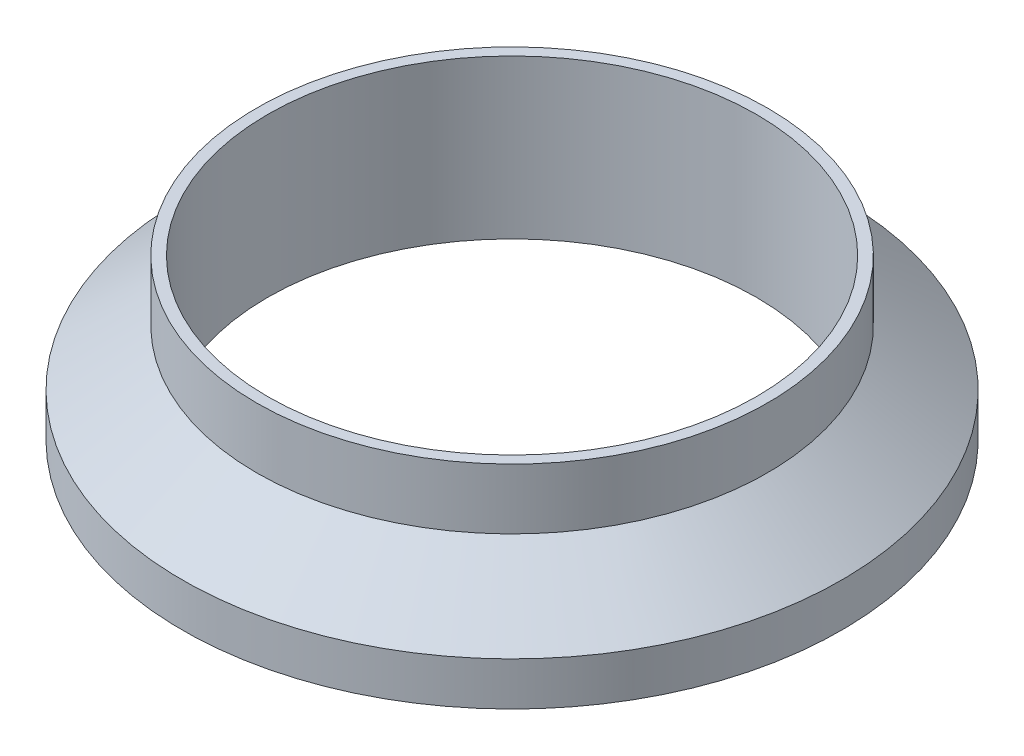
ISO-10303-21;
HEADER;
FILE_DESCRIPTION(('STEP AP214'),'2;1');
FILE_NAME('part.step','',(''),(''),'','','');
FILE_SCHEMA(('AUTOMOTIVE_DESIGN { 1 0 10303 214 1 1 1 1 }'));
ENDSEC;
DATA;
#1=APPLICATION_CONTEXT('core data for automotive mechanical design processes');
#2=APPLICATION_PROTOCOL_DEFINITION('international standard','automotive_design',2000,#1);
#3=PRODUCT_CONTEXT('',#1,'mechanical');
#4=PRODUCT('Part','Part','',(#3));
#5=PRODUCT_RELATED_PRODUCT_CATEGORY('part','',(#4));
#6=PRODUCT_DEFINITION_FORMATION('','',#4);
#7=PRODUCT_DEFINITION_CONTEXT('part definition',#1,'design');
#8=PRODUCT_DEFINITION('design','',#6,#7);
#9=PRODUCT_DEFINITION_SHAPE('','',#8);
#10=(LENGTH_UNIT() NAMED_UNIT(*) SI_UNIT(.MILLI.,.METRE.));
#11=(NAMED_UNIT(*) PLANE_ANGLE_UNIT() SI_UNIT($,.RADIAN.));
#12=(NAMED_UNIT(*) SI_UNIT($,.STERADIAN.) SOLID_ANGLE_UNIT());
#13=UNCERTAINTY_MEASURE_WITH_UNIT(LENGTH_MEASURE(1.E-05),#10,'distance_accuracy_value','');
#14=(GEOMETRIC_REPRESENTATION_CONTEXT(3) GLOBAL_UNCERTAINTY_ASSIGNED_CONTEXT((#13)) GLOBAL_UNIT_ASSIGNED_CONTEXT((#10,
#11,#12)) REPRESENTATION_CONTEXT('',''));
#15=CARTESIAN_POINT('',(0.,0.,0.));
#16=DIRECTION('',(0.,0.,1.));
#17=DIRECTION('',(1.,0.,0.));
#18=AXIS2_PLACEMENT_3D('',#15,#16,#17);
#19=CARTESIAN_POINT('',(-36.449,0.196645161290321,0.));
#20=DIRECTION('',(0.,1.,0.));
#21=DIRECTION('',(0.,0.,1.));
#22=AXIS2_PLACEMENT_3D('',#19,#20,#21);
#23=PLANE('',#22);
#24=CARTESIAN_POINT('',(0.,0.196645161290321,0.));
#25=DIRECTION('',(0.,-1.,0.));
#26=DIRECTION('',(0.,0.,-1.));
#27=AXIS2_PLACEMENT_3D('',#24,#25,#26);
#28=CIRCLE('',#27,36.449);
#29=CARTESIAN_POINT('',(0.,0.196645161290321,-36.449));
#30=VERTEX_POINT('',#29);
#31=EDGE_CURVE('E10',#30,#30,#28,.T.);
#32=ORIENTED_EDGE('',*,*,#31,.F.);
#33=EDGE_LOOP('',(#32));
#34=FACE_BOUND('',#33,.T.);
#35=CARTESIAN_POINT('',(0.,0.196645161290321,0.));
#36=DIRECTION('',(0.,-1.,0.));
#37=DIRECTION('',(0.,0.,-1.));
#38=AXIS2_PLACEMENT_3D('',#35,#36,#37);
#39=CIRCLE('',#38,40.482330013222);
#40=CARTESIAN_POINT('',(0.,0.196645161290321,-40.482330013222));
#41=VERTEX_POINT('',#40);
#42=EDGE_CURVE('E59',#41,#41,#39,.T.);
#43=ORIENTED_EDGE('',*,*,#42,.T.);
#44=EDGE_LOOP('',(#43));
#45=FACE_BOUND('',#44,.T.);
#46=ADVANCED_FACE('F31',(#34,#45),#23,.F.);
#47=CARTESIAN_POINT('',(0.,0.,0.));
#48=DIRECTION('',(0.,-1.,0.));
#49=DIRECTION('',(0.,0.,-1.));
#50=AXIS2_PLACEMENT_3D('',#47,#48,#49);
#51=CYLINDRICAL_SURFACE('',#50,36.449);
#52=CARTESIAN_POINT('',(0.,23.8252,0.));
#53=DIRECTION('',(0.,-1.,0.));
#54=DIRECTION('',(0.,0.,-1.));
#55=AXIS2_PLACEMENT_3D('',#52,#53,#54);
#56=CIRCLE('',#55,36.449);
#57=CARTESIAN_POINT('',(0.,23.8252,-36.449));
#58=VERTEX_POINT('',#57);
#59=EDGE_CURVE('E37',#58,#58,#56,.T.);
#60=ORIENTED_EDGE('',*,*,#59,.F.);
#61=EDGE_LOOP('',(#60));
#62=FACE_BOUND('',#61,.T.);
#63=ORIENTED_EDGE('',*,*,#31,.T.);
#64=EDGE_LOOP('',(#63));
#65=FACE_BOUND('',#64,.T.);
#66=ADVANCED_FACE('F96',(#62,#65),#51,.F.);
#67=CARTESIAN_POINT('',(-36.449,23.8252,0.));
#68=DIRECTION('',(0.,-1.,0.));
#69=DIRECTION('',(0.,0.,-1.));
#70=AXIS2_PLACEMENT_3D('',#67,#68,#69);
#71=PLANE('',#70);
#72=CARTESIAN_POINT('',(0.,23.8252,0.));
#73=DIRECTION('',(0.,-1.,0.));
#74=DIRECTION('',(0.,0.,-1.));
#75=AXIS2_PLACEMENT_3D('',#72,#73,#74);
#76=CIRCLE('',#75,38.1);
#77=CARTESIAN_POINT('',(0.,23.8252,-38.1));
#78=VERTEX_POINT('',#77);
#79=EDGE_CURVE('E41',#78,#78,#76,.T.);
#80=ORIENTED_EDGE('',*,*,#79,.F.);
#81=EDGE_LOOP('',(#80));
#82=FACE_BOUND('',#81,.T.);
#83=ORIENTED_EDGE('',*,*,#59,.T.);
#84=EDGE_LOOP('',(#83));
#85=FACE_BOUND('',#84,.T.);
#86=ADVANCED_FACE('F91',(#82,#85),#71,.F.);
#87=CARTESIAN_POINT('',(0.,0.,0.));
#88=DIRECTION('',(0.,-1.,0.));
#89=DIRECTION('',(0.,0.,-1.));
#90=AXIS2_PLACEMENT_3D('',#87,#88,#89);
#91=CYLINDRICAL_SURFACE('',#90,38.1);
#92=CARTESIAN_POINT('',(0.,14.8030186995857,0.));
#93=DIRECTION('',(0.,-1.,0.));
#94=DIRECTION('',(0.,0.,-1.));
#95=AXIS2_PLACEMENT_3D('',#92,#93,#94);
#96=CIRCLE('',#95,38.1);
#97=CARTESIAN_POINT('',(0.,14.8030186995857,-38.1));
#98=VERTEX_POINT('',#97);
#99=EDGE_CURVE('E45',#98,#98,#96,.T.);
#100=ORIENTED_EDGE('',*,*,#99,.F.);
#101=EDGE_LOOP('',(#100));
#102=FACE_BOUND('',#101,.T.);
#103=ORIENTED_EDGE('',*,*,#79,.T.);
#104=EDGE_LOOP('',(#103));
#105=FACE_BOUND('',#104,.T.);
#106=ADVANCED_FACE('F85',(#102,#105),#91,.T.);
#107=CARTESIAN_POINT('',(0.,14.8030186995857,0.));
#108=DIRECTION('',(0.,-1.,0.));
#109=DIRECTION('',(0.,0.,-1.));
#110=AXIS2_PLACEMENT_3D('',#107,#108,#109);
#111=CONICAL_SURFACE('',#110,38.1,0.925024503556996);
#112=CARTESIAN_POINT('',(0.,6.477,0.));
#113=DIRECTION('',(0.,-1.,0.));
#114=DIRECTION('',(0.,0.,-1.));
#115=AXIS2_PLACEMENT_3D('',#112,#113,#114);
#116=CIRCLE('',#115,49.149);
#117=CARTESIAN_POINT('',(0.,6.477,-49.149));
#118=VERTEX_POINT('',#117);
#119=EDGE_CURVE('E50',#118,#118,#116,.T.);
#120=ORIENTED_EDGE('',*,*,#119,.F.);
#121=EDGE_LOOP('',(#120));
#122=FACE_BOUND('',#121,.T.);
#123=ORIENTED_EDGE('',*,*,#99,.T.);
#124=EDGE_LOOP('',(#123));
#125=FACE_BOUND('',#124,.T.);
#126=ADVANCED_FACE('F79',(#122,#125),#111,.T.);
#127=CARTESIAN_POINT('',(0.,0.,0.));
#128=DIRECTION('',(0.,-1.,0.));
#129=DIRECTION('',(0.,0.,-1.));
#130=AXIS2_PLACEMENT_3D('',#127,#128,#129);
#131=CYLINDRICAL_SURFACE('',#130,49.149);
#132=CARTESIAN_POINT('',(0.,0.,0.));
#133=DIRECTION('',(0.,-1.,0.));
#134=DIRECTION('',(0.,0.,-1.));
#135=AXIS2_PLACEMENT_3D('',#132,#133,#134);
#136=CIRCLE('',#135,49.149);
#137=CARTESIAN_POINT('',(0.,0.,-49.149));
#138=VERTEX_POINT('',#137);
#139=EDGE_CURVE('E53',#138,#138,#136,.T.);
#140=ORIENTED_EDGE('',*,*,#139,.F.);
#141=EDGE_LOOP('',(#140));
#142=FACE_BOUND('',#141,.T.);
#143=ORIENTED_EDGE('',*,*,#119,.T.);
#144=EDGE_LOOP('',(#143));
#145=FACE_BOUND('',#144,.T.);
#146=ADVANCED_FACE('F73',(#142,#145),#131,.T.);
#147=CARTESIAN_POINT('',(-49.149,0.,0.));
#148=DIRECTION('',(0.,1.,0.));
#149=DIRECTION('',(0.,0.,1.));
#150=AXIS2_PLACEMENT_3D('',#147,#148,#149);
#151=PLANE('',#150);
#152=CARTESIAN_POINT('',(0.,0.,0.));
#153=DIRECTION('',(0.,-1.,0.));
#154=DIRECTION('',(0.,0.,-1.));
#155=AXIS2_PLACEMENT_3D('',#152,#153,#154);
#156=CIRCLE('',#155,45.1560050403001);
#157=CARTESIAN_POINT('',(0.,0.,-45.1560050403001));
#158=VERTEX_POINT('',#157);
#159=EDGE_CURVE('E56',#158,#158,#156,.T.);
#160=ORIENTED_EDGE('',*,*,#159,.F.);
#161=EDGE_LOOP('',(#160));
#162=FACE_BOUND('',#161,.T.);
#163=ORIENTED_EDGE('',*,*,#139,.T.);
#164=EDGE_LOOP('',(#163));
#165=FACE_BOUND('',#164,.T.);
#166=ADVANCED_FACE('F67',(#162,#165),#151,.F.);
#167=CARTESIAN_POINT('',(0.,-0.381,0.));
#168=DIRECTION('',(0.,-1.,0.));
#169=DIRECTION('',(0.,0.,-1.));
#170=AXIS2_PLACEMENT_3D('',#167,#168,#169);
#171=TOROIDAL_SURFACE('',#170,42.799,2.3876);
#172=ORIENTED_EDGE('',*,*,#42,.F.);
#173=EDGE_LOOP('',(#172));
#174=FACE_BOUND('',#173,.T.);
#175=ORIENTED_EDGE('',*,*,#159,.T.);
#176=EDGE_LOOP('',(#175));
#177=FACE_BOUND('',#176,.T.);
#178=ADVANCED_FACE('F64',(#174,#177),#171,.F.);
#179=CLOSED_SHELL('',(#46,#66,#86,#106,#126,#146,#166,#178));
#180=MANIFOLD_SOLID_BREP('B2',#179);
#181=ADVANCED_BREP_SHAPE_REPRESENTATION('',(#18,#180),#14);
#182=SHAPE_DEFINITION_REPRESENTATION(#9,#181);
ENDSEC;
END-ISO-10303-21;
